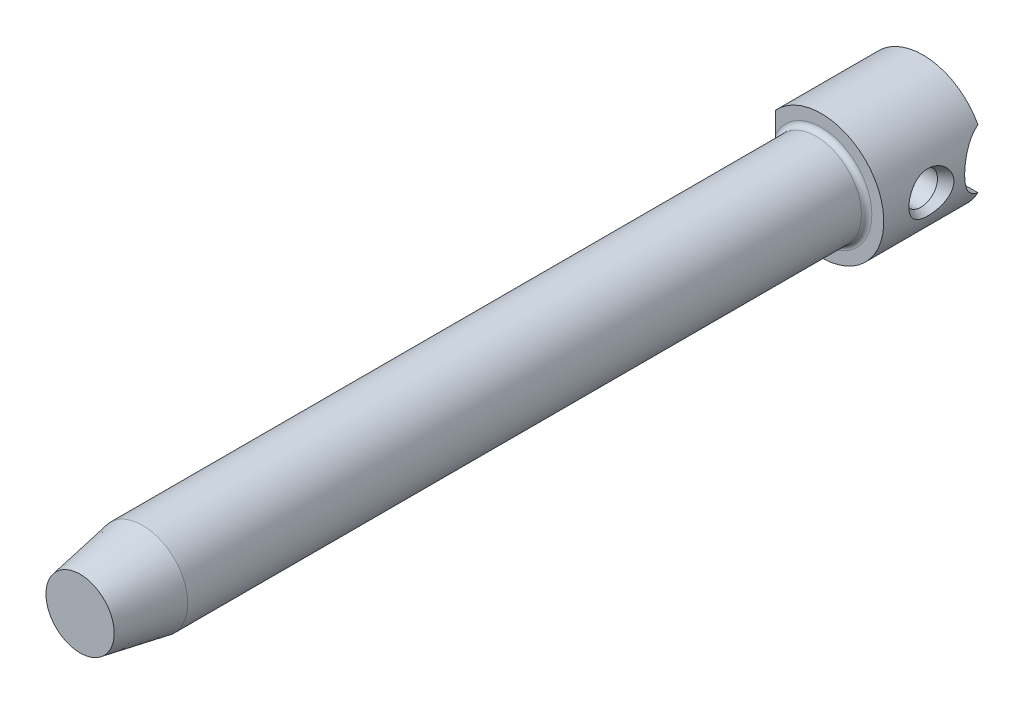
ISO-10303-21;
HEADER;
FILE_DESCRIPTION(('STEP AP214'),'2;1');
FILE_NAME('part.step','',(''),(''),'','','');
FILE_SCHEMA(('AUTOMOTIVE_DESIGN { 1 0 10303 214 1 1 1 1 }'));
ENDSEC;
DATA;
#1=APPLICATION_CONTEXT('core data for automotive mechanical design processes');
#2=APPLICATION_PROTOCOL_DEFINITION('international standard','automotive_design',2000,#1);
#3=PRODUCT_CONTEXT('',#1,'mechanical');
#4=PRODUCT('Part','Part','',(#3));
#5=PRODUCT_RELATED_PRODUCT_CATEGORY('part','',(#4));
#6=PRODUCT_DEFINITION_FORMATION('','',#4);
#7=PRODUCT_DEFINITION_CONTEXT('part definition',#1,'design');
#8=PRODUCT_DEFINITION('design','',#6,#7);
#9=PRODUCT_DEFINITION_SHAPE('','',#8);
#10=(LENGTH_UNIT() NAMED_UNIT(*) SI_UNIT(.MILLI.,.METRE.));
#11=(NAMED_UNIT(*) PLANE_ANGLE_UNIT() SI_UNIT($,.RADIAN.));
#12=(NAMED_UNIT(*) SI_UNIT($,.STERADIAN.) SOLID_ANGLE_UNIT());
#13=UNCERTAINTY_MEASURE_WITH_UNIT(LENGTH_MEASURE(1.E-05),#10,'distance_accuracy_value','');
#14=(GEOMETRIC_REPRESENTATION_CONTEXT(3) GLOBAL_UNCERTAINTY_ASSIGNED_CONTEXT((#13)) GLOBAL_UNIT_ASSIGNED_CONTEXT((#10,
#11,#12)) REPRESENTATION_CONTEXT('',''));
#15=CARTESIAN_POINT('',(0.,0.,0.));
#16=DIRECTION('',(0.,0.,1.));
#17=DIRECTION('',(1.,0.,0.));
#18=AXIS2_PLACEMENT_3D('',#15,#16,#17);
#19=CARTESIAN_POINT('',(0.,4.76249999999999,-4.1148));
#20=DIRECTION('',(0.,0.,1.));
#21=DIRECTION('',(1.,0.,0.));
#22=AXIS2_PLACEMENT_3D('',#19,#20,#21);
#23=PLANE('',#22);
#24=CARTESIAN_POINT('',(0.,0.,-4.1148));
#25=DIRECTION('',(0.,0.,1.));
#26=DIRECTION('',(1.,0.,0.));
#27=AXIS2_PLACEMENT_3D('',#24,#25,#26);
#28=CIRCLE('',#27,4.7625);
#29=CARTESIAN_POINT('',(4.20254878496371,2.24053340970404,-4.1148));
#30=VERTEX_POINT('',#29);
#31=CARTESIAN_POINT('',(-3.4798,3.2515224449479,-4.1148));
#32=VERTEX_POINT('',#31);
#33=EDGE_CURVE('E95',#30,#32,#28,.T.);
#34=ORIENTED_EDGE('',*,*,#33,.F.);
#35=DIRECTION('',(-1.,0.,0.));
#36=VECTOR('',#35,1.);
#37=CARTESIAN_POINT('',(4.7625,2.24053340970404,-4.1148));
#38=LINE('',#37,#36);
#39=CARTESIAN_POINT('',(-3.4798,2.24053340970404,-4.1148));
#40=VERTEX_POINT('',#39);
#41=EDGE_CURVE('E86',#30,#40,#38,.T.);
#42=ORIENTED_EDGE('',*,*,#41,.T.);
#43=DIRECTION('',(0.,-1.,0.));
#44=VECTOR('',#43,1.);
#45=CARTESIAN_POINT('',(-3.4798,3.2515224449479,-4.1148));
#46=LINE('',#45,#44);
#47=EDGE_CURVE('E94',#32,#40,#46,.T.);
#48=ORIENTED_EDGE('',*,*,#47,.F.);
#49=EDGE_LOOP('',(#34,#42,#48));
#50=FACE_BOUND('',#49,.T.);
#51=ADVANCED_FACE('F35',(#50),#23,.F.);
#52=CARTESIAN_POINT('',(-3.4798,-2.24053340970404,-4.1148));
#53=VERTEX_POINT('',#52);
#54=CARTESIAN_POINT('',(-3.4798,-3.2515224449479,-4.1148));
#55=VERTEX_POINT('',#54);
#56=EDGE_CURVE('E101',#53,#55,#46,.T.);
#57=ORIENTED_EDGE('',*,*,#56,.F.);
#58=DIRECTION('',(-1.,0.,0.));
#59=VECTOR('',#58,1.);
#60=CARTESIAN_POINT('',(4.7625,-2.24053340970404,-4.1148));
#61=LINE('',#60,#59);
#62=CARTESIAN_POINT('',(4.20254878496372,-2.24053340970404,-4.1148));
#63=VERTEX_POINT('',#62);
#64=EDGE_CURVE('E53',#63,#53,#61,.T.);
#65=ORIENTED_EDGE('',*,*,#64,.F.);
#66=EDGE_CURVE('E131',#55,#63,#28,.T.);
#67=ORIENTED_EDGE('',*,*,#66,.F.);
#68=EDGE_LOOP('',(#57,#65,#67));
#69=FACE_BOUND('',#68,.T.);
#70=ADVANCED_FACE('F37',(#69),#23,.F.);
#71=CARTESIAN_POINT('',(0.,0.,60.17895));
#72=DIRECTION('',(0.,0.,1.));
#73=DIRECTION('',(1.,0.,0.));
#74=AXIS2_PLACEMENT_3D('',#71,#72,#73);
#75=CYLINDRICAL_SURFACE('',#74,4.7625);
#76=CARTESIAN_POINT('',(4.62280607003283,-1.14501978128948,-1.16700098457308));
#77=CARTESIAN_POINT('',(4.60822032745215,-1.20390915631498,-1.09742034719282));
#78=CARTESIAN_POINT('',(4.5938462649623,-1.25713064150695,-1.02297208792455));
#79=CARTESIAN_POINT('',(4.56700143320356,-1.35141195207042,-0.8663937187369));
#80=CARTESIAN_POINT('',(4.55453204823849,-1.39246295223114,-0.784258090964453));
#81=CARTESIAN_POINT('',(4.53201445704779,-1.46416186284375,-0.608377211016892));
#82=CARTESIAN_POINT('',(4.52219671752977,-1.49388085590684,-0.514221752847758));
#83=CARTESIAN_POINT('',(4.50737893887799,-1.53801433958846,-0.322037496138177));
#84=CARTESIAN_POINT('',(4.50237852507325,-1.55243002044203,-0.224008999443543));
#85=CARTESIAN_POINT('',(4.49777314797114,-1.56572567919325,-0.0255009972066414));
#86=CARTESIAN_POINT('',(4.49823845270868,-1.5644033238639,0.0749938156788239));
#87=CARTESIAN_POINT('',(4.50467786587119,-1.54576110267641,0.274311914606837));
#88=CARTESIAN_POINT('',(4.51065239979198,-1.52844000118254,0.373135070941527));
#89=CARTESIAN_POINT('',(4.52733932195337,-1.47827426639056,0.566000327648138));
#90=CARTESIAN_POINT('',(4.538036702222,-1.44547878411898,0.660056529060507));
#91=CARTESIAN_POINT('',(4.56287938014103,-1.36502854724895,0.841125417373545));
#92=CARTESIAN_POINT('',(4.57702546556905,-1.31737039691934,0.928136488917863));
#93=CARTESIAN_POINT('',(4.60713375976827,-1.20787103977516,1.09281234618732));
#94=CARTESIAN_POINT('',(4.62310159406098,-1.14598526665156,1.17044656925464));
#95=CARTESIAN_POINT('',(4.65486662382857,-1.00922487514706,1.31338735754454));
#96=CARTESIAN_POINT('',(4.67066385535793,-0.934353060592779,1.37869657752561));
#97=CARTESIAN_POINT('',(4.69924475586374,-0.777504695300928,1.49112404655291));
#98=CARTESIAN_POINT('',(4.71214312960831,-0.696107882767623,1.53901759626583));
#99=CARTESIAN_POINT('',(4.73421636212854,-0.525332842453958,1.61872224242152));
#100=CARTESIAN_POINT('',(4.74339540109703,-0.435963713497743,1.65055140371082));
#101=CARTESIAN_POINT('',(4.75592212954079,-0.263110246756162,1.69349239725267));
#102=CARTESIAN_POINT('',(4.75982572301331,-0.180157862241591,1.70658988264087));
#103=CARTESIAN_POINT('',(4.76321218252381,-0.013165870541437,1.71796842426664));
#104=CARTESIAN_POINT('',(4.76269728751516,0.0708731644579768,1.71625698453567));
#105=CARTESIAN_POINT('',(4.75753391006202,0.230562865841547,1.69886217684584));
#106=CARTESIAN_POINT('',(4.75321662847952,0.306350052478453,1.68429811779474));
#107=CARTESIAN_POINT('',(4.74135413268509,0.454406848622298,1.64342553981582));
#108=CARTESIAN_POINT('',(4.73380866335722,0.526676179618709,1.61711609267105));
#109=CARTESIAN_POINT('',(4.71597944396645,0.66795088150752,1.55298124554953));
#110=CARTESIAN_POINT('',(4.70562614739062,0.736811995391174,1.51485926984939));
#111=CARTESIAN_POINT('',(4.68324890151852,0.867759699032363,1.42876996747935));
#112=CARTESIAN_POINT('',(4.67122433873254,0.929843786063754,1.38079902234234));
#113=CARTESIAN_POINT('',(4.64525864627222,1.05227824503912,1.27106111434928));
#114=CARTESIAN_POINT('',(4.63124745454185,1.11179724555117,1.20838367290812));
#115=CARTESIAN_POINT('',(4.60377487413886,1.2205808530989,1.07457765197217));
#116=CARTESIAN_POINT('',(4.59031375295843,1.2698405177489,1.00344502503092));
#117=CARTESIAN_POINT('',(4.56389388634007,1.36191377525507,0.846815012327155));
#118=CARTESIAN_POINT('',(4.55112725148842,1.40355321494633,0.76059252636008));
#119=CARTESIAN_POINT('',(4.52918423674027,1.47282789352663,0.582263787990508));
#120=CARTESIAN_POINT('',(4.52000848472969,1.50046068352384,0.490156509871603));
#121=CARTESIAN_POINT('',(4.50601038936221,1.54200702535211,0.298646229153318));
#122=CARTESIAN_POINT('',(4.50137827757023,1.55532316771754,0.199098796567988));
#123=CARTESIAN_POINT('',(4.49770965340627,1.56590117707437,-0.000943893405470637));
#124=CARTESIAN_POINT('',(4.49867305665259,1.56316328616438,-0.101439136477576));
#125=CARTESIAN_POINT('',(4.50605763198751,1.54174416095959,-0.30011429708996));
#126=CARTESIAN_POINT('',(4.51245771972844,1.52312451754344,-0.398301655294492));
#127=CARTESIAN_POINT('',(4.5298991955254,1.47043630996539,-0.590021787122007));
#128=CARTESIAN_POINT('',(4.54094137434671,1.43636511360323,-0.683553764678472));
#129=CARTESIAN_POINT('',(4.56639538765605,1.35326605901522,-0.863732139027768));
#130=CARTESIAN_POINT('',(4.58082161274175,1.30417404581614,-0.95034695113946));
#131=CARTESIAN_POINT('',(4.61129537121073,1.19194501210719,-1.11368045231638));
#132=CARTESIAN_POINT('',(4.62734312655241,1.1288060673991,-1.19039778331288));
#133=CARTESIAN_POINT('',(4.65879285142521,0.990935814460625,-1.32993884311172));
#134=CARTESIAN_POINT('',(4.6742012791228,0.916441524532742,-1.39299410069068));
#135=CARTESIAN_POINT('',(4.70270212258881,0.756671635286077,-1.50424579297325));
#136=CARTESIAN_POINT('',(4.71579645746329,0.671405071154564,-1.55245456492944));
#137=CARTESIAN_POINT('',(4.73676115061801,0.501136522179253,-1.62759493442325));
#138=CARTESIAN_POINT('',(4.74501080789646,0.416885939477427,-1.65611808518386));
#139=CARTESIAN_POINT('',(4.75701397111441,0.244287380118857,-1.69720047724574));
#140=CARTESIAN_POINT('',(4.7607716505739,0.15594328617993,-1.70977453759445));
#141=CARTESIAN_POINT('',(4.76314136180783,-0.0117272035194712,-1.71772253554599));
#142=CARTESIAN_POINT('',(4.76227746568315,-0.0909680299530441,-1.71484810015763));
#143=CARTESIAN_POINT('',(4.75669850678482,-0.247737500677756,-1.6960417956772));
#144=CARTESIAN_POINT('',(4.75198369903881,-0.325266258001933,-1.68011079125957));
#145=CARTESIAN_POINT('',(4.73936339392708,-0.474707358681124,-1.63648954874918));
#146=CARTESIAN_POINT('',(4.73153265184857,-0.546707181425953,-1.6090740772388));
#147=CARTESIAN_POINT('',(4.71344491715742,-0.685373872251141,-1.54367274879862));
#148=CARTESIAN_POINT('',(4.7031878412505,-0.752040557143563,-1.50568652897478));
#149=CARTESIAN_POINT('',(4.68146867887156,-0.877023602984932,-1.42167289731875));
#150=CARTESIAN_POINT('',(4.67004955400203,-0.935524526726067,-1.37590715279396));
#151=CARTESIAN_POINT('',(4.64664252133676,-1.04560489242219,-1.27683335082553));
#152=CARTESIAN_POINT('',(4.63465445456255,-1.09718238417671,-1.22352317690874));
#153=CARTESIAN_POINT('',(4.62280607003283,-1.14501978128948,-1.16700098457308));
#154=B_SPLINE_CURVE_WITH_KNOTS('',3,(#76,#77,#78,#79,#80,#81,#82,#83,#84,#85,#86,#87,#88,#89,
#90,#91,#92,#93,#94,#95,#96,#97,#98,#99,#100,#101,#102,#103,#104,#105,#106,#107,#108,#109,#110,
#111,#112,#113,#114,#115,#116,#117,#118,#119,#120,#121,#122,#123,#124,#125,#126,#127,#128,#129,
#130,#131,#132,#133,#134,#135,#136,#137,#138,#139,#140,#141,#142,#143,#144,#145,#146,#147,#148,
#149,#150,#151,#152,#153),.UNSPECIFIED.,.T.,.F.,(4,2,2,2,2,2,2,2,2,2,2,2,2,2,2,2,2,2,2,2,2,2,2,
2,2,2,2,2,2,2,2,2,2,2,2,2,2,2,4),(0.,0.276702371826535,0.553604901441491,0.849882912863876,
1.14613787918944,1.44620566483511,1.7462966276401,2.04544076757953,2.34465330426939,
2.64481617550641,2.94491431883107,3.2292498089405,3.51326483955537,3.76410498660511,
4.01481803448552,4.24563945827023,4.47647912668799,4.71366192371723,4.95093201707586,
5.21254516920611,5.47428406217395,5.76278622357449,6.05133880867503,6.3515136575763,
6.65168397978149,6.95069547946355,7.2497579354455,7.55011597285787,7.85051517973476,
8.14533651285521,8.43991218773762,8.70637396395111,8.97258797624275,9.20930140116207,
9.44599915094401,9.67733101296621,9.9086708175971,10.1333803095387,10.3581529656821),.UNSPECIFIED.);
#155=CARTESIAN_POINT('',(4.62280607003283,-1.14501978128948,-1.16700098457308));
#156=VERTEX_POINT('',#155);
#157=EDGE_CURVE('E11',#156,#156,#154,.T.);
#158=ORIENTED_EDGE('',*,*,#157,.T.);
#159=EDGE_LOOP('',(#158));
#160=FACE_BOUND('',#159,.T.);
#161=ORIENTED_EDGE('',*,*,#66,.T.);
#162=CARTESIAN_POINT('',(4.20254878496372,-2.24053340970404,-4.1148));
#163=CARTESIAN_POINT('',(4.22731920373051,-2.19403434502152,-3.98559059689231));
#164=CARTESIAN_POINT('',(4.25690380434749,-2.13675005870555,-3.86151437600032));
#165=CARTESIAN_POINT('',(4.32155477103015,-2.00277569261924,-3.62604764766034));
#166=CARTESIAN_POINT('',(4.35661484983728,-1.92610780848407,-3.51464284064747));
#167=CARTESIAN_POINT('',(4.42808293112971,-1.75556436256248,-3.30681491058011));
#168=CARTESIAN_POINT('',(4.46448847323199,-1.66171907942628,-3.21036596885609));
#169=CARTESIAN_POINT('',(4.53492318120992,-1.45857175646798,-3.0341913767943));
#170=CARTESIAN_POINT('',(4.56895141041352,-1.34926367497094,-2.95447229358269));
#171=CARTESIAN_POINT('',(4.63180913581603,-1.11480548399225,-2.81251813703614));
#172=CARTESIAN_POINT('',(4.66050412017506,-0.989353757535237,-2.75071779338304));
#173=CARTESIAN_POINT('',(4.70839839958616,-0.727996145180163,-2.64969760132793));
#174=CARTESIAN_POINT('',(4.72760632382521,-0.592099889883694,-2.61045722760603));
#175=CARTESIAN_POINT('',(4.75296288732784,-0.326914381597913,-2.55903735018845));
#176=CARTESIAN_POINT('',(4.7601324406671,-0.198133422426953,-2.54473779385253));
#177=CARTESIAN_POINT('',(4.76386846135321,0.0601775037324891,-2.53726071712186));
#178=CARTESIAN_POINT('',(4.76043871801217,0.189707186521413,-2.54407564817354));
#179=CARTESIAN_POINT('',(4.74396162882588,0.436448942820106,-2.57725817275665));
#180=CARTESIAN_POINT('',(4.73159068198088,0.553896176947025,-2.60225138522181));
#181=CARTESIAN_POINT('',(4.69916175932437,0.782716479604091,-2.66915762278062));
#182=CARTESIAN_POINT('',(4.67910342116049,0.894089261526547,-2.711071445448));
#183=CARTESIAN_POINT('',(4.63212330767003,1.11257494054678,-2.81231668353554));
#184=CARTESIAN_POINT('',(4.60496200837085,1.21934650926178,-2.87226993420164));
#185=CARTESIAN_POINT('',(4.54654132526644,1.42179183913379,-3.00717638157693));
#186=CARTESIAN_POINT('',(4.51527806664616,1.51745494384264,-3.08214379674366));
#187=CARTESIAN_POINT('',(4.44805269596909,1.70503127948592,-3.25362856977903));
#188=CARTESIAN_POINT('',(4.41193413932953,1.79560108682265,-3.35155460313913));
#189=CARTESIAN_POINT('',(4.34169262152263,1.95934811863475,-3.56148079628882));
#190=CARTESIAN_POINT('',(4.30756650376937,2.03255344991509,-3.67345775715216));
#191=CARTESIAN_POINT('',(4.26274029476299,2.12401101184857,-3.84310383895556));
#192=CARTESIAN_POINT('',(4.24962944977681,2.15006905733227,-3.89604116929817));
#193=CARTESIAN_POINT('',(4.22489698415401,2.19826703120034,-4.00393997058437));
#194=CARTESIAN_POINT('',(4.21327393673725,2.22041072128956,-4.05889943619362));
#195=CARTESIAN_POINT('',(4.20254878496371,2.24053340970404,-4.1148));
#196=B_SPLINE_CURVE_WITH_KNOTS('',3,(#162,#163,#164,#165,#166,#167,#168,#169,#170,#171,#172,
#173,#174,#175,#176,#177,#178,#179,#180,#181,#182,#183,#184,#185,#186,#187,#188,#189,#190,#191,
#192,#193,#194,#195),.UNSPECIFIED.,.F.,.F.,(4,2,2,2,2,2,2,2,2,2,2,2,2,2,2,2,4),(0.,
0.417608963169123,0.834741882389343,1.25114647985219,1.66771422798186,2.09367415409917,
2.5192459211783,2.906464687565,3.29354503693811,3.65405282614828,4.01457761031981,
4.38932361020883,4.76442618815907,5.17723212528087,5.58936524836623,5.77054044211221,
5.95154056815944),.UNSPECIFIED.);
#197=EDGE_CURVE('E105',#63,#30,#196,.T.);
#198=ORIENTED_EDGE('',*,*,#197,.T.);
#199=ORIENTED_EDGE('',*,*,#33,.T.);
#200=DIRECTION('',(0.,0.,-1.));
#201=VECTOR('',#200,1.);
#202=CARTESIAN_POINT('',(-3.4798,3.2515224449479,60.17895));
#203=LINE('',#202,#201);
#204=CARTESIAN_POINT('',(-3.4798,3.2515224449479,3.6322));
#205=VERTEX_POINT('',#204);
#206=EDGE_CURVE('E100',#205,#32,#203,.T.);
#207=ORIENTED_EDGE('',*,*,#206,.F.);
#208=CARTESIAN_POINT('',(0.,0.,3.6322));
#209=DIRECTION('',(0.,0.,1.));
#210=DIRECTION('',(1.,0.,0.));
#211=AXIS2_PLACEMENT_3D('',#208,#209,#210);
#212=CIRCLE('',#211,4.7625);
#213=CARTESIAN_POINT('',(-3.4798,-3.2515224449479,3.6322));
#214=VERTEX_POINT('',#213);
#215=EDGE_CURVE('E128',#214,#205,#212,.T.);
#216=ORIENTED_EDGE('',*,*,#215,.F.);
#217=DIRECTION('',(0.,0.,-1.));
#218=VECTOR('',#217,1.);
#219=CARTESIAN_POINT('',(-3.4798,-3.2515224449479,60.17895));
#220=LINE('',#219,#218);
#221=EDGE_CURVE('E103',#214,#55,#220,.T.);
#222=ORIENTED_EDGE('',*,*,#221,.T.);
#223=EDGE_LOOP('',(#161,#198,#199,#207,#216,#222));
#224=FACE_BOUND('',#223,.T.);
#225=ADVANCED_FACE('F168',(#160,#224),#75,.T.);
#226=CARTESIAN_POINT('',(0.,3.85127499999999,3.6322));
#227=DIRECTION('',(0.,0.,-1.));
#228=DIRECTION('',(-1.,0.,0.));
#229=AXIS2_PLACEMENT_3D('',#226,#227,#228);
#230=PLANE('',#229);
#231=ORIENTED_EDGE('',*,*,#215,.T.);
#232=DIRECTION('',(0.,-1.,0.));
#233=VECTOR('',#232,1.);
#234=CARTESIAN_POINT('',(-3.4798,3.85127499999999,3.6322));
#235=LINE('',#234,#233);
#236=CARTESIAN_POINT('',(-3.4798,1.65024576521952,3.6322));
#237=VERTEX_POINT('',#236);
#238=EDGE_CURVE('E115',#205,#237,#235,.T.);
#239=ORIENTED_EDGE('',*,*,#238,.T.);
#240=CARTESIAN_POINT('',(0.,0.,3.6322));
#241=DIRECTION('',(0.,0.,1.));
#242=DIRECTION('',(1.,0.,0.));
#243=AXIS2_PLACEMENT_3D('',#240,#241,#242);
#244=CIRCLE('',#243,3.851275);
#245=CARTESIAN_POINT('',(-3.47980000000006,-1.65024576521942,3.6322));
#246=VERTEX_POINT('',#245);
#247=EDGE_CURVE('E125',#246,#237,#244,.T.);
#248=ORIENTED_EDGE('',*,*,#247,.F.);
#249=EDGE_CURVE('E61',#246,#214,#235,.T.);
#250=ORIENTED_EDGE('',*,*,#249,.T.);
#251=EDGE_LOOP('',(#231,#239,#248,#250));
#252=FACE_BOUND('',#251,.T.);
#253=ADVANCED_FACE('F160',(#252),#230,.F.);
#254=CARTESIAN_POINT('',(0.,0.,4.029075));
#255=DIRECTION('',(0.,0.,1.));
#256=DIRECTION('',(1.,0.,0.));
#257=AXIS2_PLACEMENT_3D('',#254,#255,#256);
#258=TOROIDAL_SURFACE('',#257,3.851275,0.396875);
#259=CARTESIAN_POINT('',(0.,0.,4.02907500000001));
#260=DIRECTION('',(0.,0.,1.));
#261=DIRECTION('',(1.,0.,0.));
#262=AXIS2_PLACEMENT_3D('',#259,#260,#261);
#263=CIRCLE('',#262,3.4544);
#264=CARTESIAN_POINT('',(3.4544,0.,4.02907500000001));
#265=VERTEX_POINT('',#264);
#266=EDGE_CURVE('E122',#265,#265,#263,.T.);
#267=ORIENTED_EDGE('',*,*,#266,.F.);
#268=EDGE_LOOP('',(#267));
#269=FACE_BOUND('',#268,.T.);
#270=ORIENTED_EDGE('',*,*,#247,.T.);
#271=CARTESIAN_POINT('',(-3.4798,0.,3.889375));
#272=CARTESIAN_POINT('',(-3.4798,-0.0536264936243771,3.88937625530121));
#273=CARTESIAN_POINT('',(-3.4798,-0.107252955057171,3.88593063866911));
#274=CARTESIAN_POINT('',(-3.4798,-0.214085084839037,3.8738463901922));
#275=CARTESIAN_POINT('',(-3.4798,-0.267287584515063,3.86518339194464));
#276=CARTESIAN_POINT('',(-3.4798,-0.374235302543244,3.84506610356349));
#277=CARTESIAN_POINT('',(-3.4798,-0.427969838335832,3.83355906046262));
#278=CARTESIAN_POINT('',(-3.4798,-0.535119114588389,3.80960553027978));
#279=CARTESIAN_POINT('',(-3.4798,-0.588534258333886,3.79716078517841));
#280=CARTESIAN_POINT('',(-3.4798,-0.695334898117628,3.77235472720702));
#281=CARTESIAN_POINT('',(-3.4798,-0.748720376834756,3.75999334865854));
#282=CARTESIAN_POINT('',(-3.4798,-0.855662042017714,3.73604212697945));
#283=CARTESIAN_POINT('',(-3.4798,-0.909218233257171,3.72445230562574));
#284=CARTESIAN_POINT('',(-3.4798,-1.07061074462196,3.69161409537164));
#285=CARTESIAN_POINT('',(-3.4798,-1.17889915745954,3.67236647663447));
#286=CARTESIAN_POINT('',(-3.4798,-1.34119739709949,3.6509931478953));
#287=CARTESIAN_POINT('',(-3.4798,-1.39470759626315,3.64514228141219));
#288=CARTESIAN_POINT('',(-3.4798,-1.50196292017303,3.63642696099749));
#289=CARTESIAN_POINT('',(-3.4798,-1.55570793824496,3.63356126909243));
#290=CARTESIAN_POINT('',(-3.4798,-1.66303675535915,3.63159635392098));
#291=CARTESIAN_POINT('',(-3.4798,-1.71662017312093,3.63248002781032));
#292=CARTESIAN_POINT('',(-3.4798,-1.8234760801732,3.63898533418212));
#293=CARTESIAN_POINT('',(-3.4798,-1.8767489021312,3.64460026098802));
#294=CARTESIAN_POINT('',(-3.4798,-1.9609844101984,3.65848373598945));
#295=CARTESIAN_POINT('',(-3.4798,-1.99227269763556,3.66476630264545));
#296=CARTESIAN_POINT('',(-3.4798,-2.05431309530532,3.67997271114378));
#297=CARTESIAN_POINT('',(-3.4798,-2.08506346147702,3.68890389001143));
#298=CARTESIAN_POINT('',(-3.4798,-2.14566954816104,3.7100064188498));
#299=CARTESIAN_POINT('',(-3.4798,-2.17551844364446,3.72219774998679));
#300=CARTESIAN_POINT('',(-3.4798,-2.23328638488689,3.75050329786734));
#301=CARTESIAN_POINT('',(-3.4798,-2.26121040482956,3.76660687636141));
#302=CARTESIAN_POINT('',(-3.4798,-2.30296050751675,3.79603726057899));
#303=CARTESIAN_POINT('',(-3.4798,-2.31788057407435,3.80780485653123));
#304=CARTESIAN_POINT('',(-3.4798,-2.3460793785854,3.83321909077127));
#305=CARTESIAN_POINT('',(-3.4798,-2.3593569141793,3.84686709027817));
#306=CARTESIAN_POINT('',(-3.4798,-2.3837429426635,3.87635118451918));
#307=CARTESIAN_POINT('',(-3.4798,-2.39481769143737,3.89221578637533));
#308=CARTESIAN_POINT('',(-3.4798,-2.41357176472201,3.92583596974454));
#309=CARTESIAN_POINT('',(-3.4798,-2.42126270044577,3.94358482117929));
#310=CARTESIAN_POINT('',(-3.4798,-2.43053372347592,3.97448842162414));
#311=CARTESIAN_POINT('',(-3.4798,-2.43328172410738,3.98729583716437));
#312=CARTESIAN_POINT('',(-3.4798,-2.43656931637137,4.0131922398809));
#313=CARTESIAN_POINT('',(-3.4798,-2.43711015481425,4.0262810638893));
#314=CARTESIAN_POINT('',(-3.4798,-2.43593700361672,4.05235500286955));
#315=CARTESIAN_POINT('',(-3.4798,-2.43422301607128,4.06534011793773));
#316=CARTESIAN_POINT('',(-3.4798,-2.42868132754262,4.09084952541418));
#317=CARTESIAN_POINT('',(-3.4798,-2.42485230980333,4.10337352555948));
#318=CARTESIAN_POINT('',(-3.4798,-2.41414195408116,4.13076855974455));
#319=CARTESIAN_POINT('',(-3.4798,-2.40673375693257,4.14543276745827));
#320=CARTESIAN_POINT('',(-3.4798,-2.3896325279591,4.17335673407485));
#321=CARTESIAN_POINT('',(-3.4798,-2.37993556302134,4.18661401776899));
#322=CARTESIAN_POINT('',(-3.4798,-2.3540602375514,4.2173219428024));
#323=CARTESIAN_POINT('',(-3.4798,-2.33693132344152,4.2339666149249));
#324=CARTESIAN_POINT('',(-3.4798,-2.30033404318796,4.26441731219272));
#325=CARTESIAN_POINT('',(-3.4798,-2.28086080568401,4.27821725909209));
#326=CARTESIAN_POINT('',(-3.4798,-2.22637192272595,4.31206674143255));
#327=CARTESIAN_POINT('',(-3.4798,-2.18993978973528,4.32981713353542));
#328=CARTESIAN_POINT('',(-3.4798,-2.11492101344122,4.35986491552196));
#329=CARTESIAN_POINT('',(-3.4798,-2.07632889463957,4.37214766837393));
#330=CARTESIAN_POINT('',(-3.4798,-1.9992122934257,4.39210909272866));
#331=CARTESIAN_POINT('',(-3.4798,-1.96071929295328,4.39991270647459));
#332=CARTESIAN_POINT('',(-3.4798,-1.88319847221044,4.41223978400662));
#333=CARTESIAN_POINT('',(-3.4798,-1.84417016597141,4.4167600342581));
#334=CARTESIAN_POINT('',(-3.4798,-1.72675914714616,4.42629220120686));
#335=CARTESIAN_POINT('',(-3.4798,-1.64805187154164,4.427275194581));
#336=CARTESIAN_POINT('',(-3.4798,-1.50309429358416,4.42215275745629));
#337=CARTESIAN_POINT('',(-3.4798,-1.43678660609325,4.41711237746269));
#338=CARTESIAN_POINT('',(-3.4798,-1.30459753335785,4.40296605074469));
#339=CARTESIAN_POINT('',(-3.4798,-1.23871625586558,4.39385911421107));
#340=CARTESIAN_POINT('',(-3.4798,-1.10703047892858,4.37258962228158));
#341=CARTESIAN_POINT('',(-3.4798,-1.04122924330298,4.36040764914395));
#342=CARTESIAN_POINT('',(-3.4798,-0.910097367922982,4.33399954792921));
#343=CARTESIAN_POINT('',(-3.4798,-0.844766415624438,4.31977494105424));
#344=CARTESIAN_POINT('',(-3.4798,-0.709396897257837,4.28918694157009));
#345=CARTESIAN_POINT('',(-3.4798,-0.639377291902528,4.27274316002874));
#346=CARTESIAN_POINT('',(-3.4798,-0.499062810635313,4.24032493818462));
#347=CARTESIAN_POINT('',(-3.4798,-0.428767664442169,4.22435151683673));
#348=CARTESIAN_POINT('',(-3.4798,-0.323298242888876,4.2033355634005));
#349=CARTESIAN_POINT('',(-3.4798,-0.28841990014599,4.19686182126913));
#350=CARTESIAN_POINT('',(-3.4798,-0.218402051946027,4.18549431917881));
#351=CARTESIAN_POINT('',(-3.4798,-0.183262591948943,4.1806002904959));
#352=CARTESIAN_POINT('',(-3.4798,-0.112887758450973,4.17315606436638));
#353=CARTESIAN_POINT('',(-3.4798,-0.0776536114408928,4.17059496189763));
#354=CARTESIAN_POINT('',(-3.4798,-0.00709755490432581,4.16832333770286));
#355=CARTESIAN_POINT('',(-3.4798,0.0282243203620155,4.1686118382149));
#356=CARTESIAN_POINT('',(-3.4798,0.134266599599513,4.17370438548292));
#357=CARTESIAN_POINT('',(-3.4798,0.204765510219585,4.18276849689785));
#358=CARTESIAN_POINT('',(-3.4798,0.309801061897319,4.2007350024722));
#359=CARTESIAN_POINT('',(-3.4798,0.344799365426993,4.20747944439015));
#360=CARTESIAN_POINT('',(-3.4798,0.414625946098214,4.22180690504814));
#361=CARTESIAN_POINT('',(-3.4798,0.449454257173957,4.22938974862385));
#362=CARTESIAN_POINT('',(-3.4798,0.555102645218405,4.25302113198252));
#363=CARTESIAN_POINT('',(-3.4798,0.625776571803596,4.26969097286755));
#364=CARTESIAN_POINT('',(-3.4798,0.767106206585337,4.302359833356));
#365=CARTESIAN_POINT('',(-3.4798,0.837761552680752,4.31836036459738));
#366=CARTESIAN_POINT('',(-3.4798,0.979421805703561,4.34833105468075));
#367=CARTESIAN_POINT('',(-3.4798,1.05042617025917,4.36230370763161));
#368=CARTESIAN_POINT('',(-3.4798,1.19309785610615,4.38702502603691));
#369=CARTESIAN_POINT('',(-3.4798,1.26476583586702,4.39777003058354));
#370=CARTESIAN_POINT('',(-3.4798,1.40839640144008,4.41464614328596));
#371=CARTESIAN_POINT('',(-3.4798,1.48035692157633,4.42079414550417));
#372=CARTESIAN_POINT('',(-3.4798,1.6245119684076,4.4268824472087));
#373=CARTESIAN_POINT('',(-3.4798,1.69670595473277,4.42683241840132));
#374=CARTESIAN_POINT('',(-3.4798,1.80521513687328,4.42030096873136));
#375=CARTESIAN_POINT('',(-3.4798,1.84172051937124,4.41699343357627));
#376=CARTESIAN_POINT('',(-3.4798,1.91438422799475,4.40772300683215));
#377=CARTESIAN_POINT('',(-3.4798,1.95054276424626,4.40176184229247));
#378=CARTESIAN_POINT('',(-3.4798,2.02200406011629,4.38666975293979));
#379=CARTESIAN_POINT('',(-3.4798,2.05731040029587,4.37755621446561));
#380=CARTESIAN_POINT('',(-3.4798,2.12665191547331,4.35543126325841));
#381=CARTESIAN_POINT('',(-3.4798,2.16068967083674,4.34242831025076));
#382=CARTESIAN_POINT('',(-3.4798,2.21936442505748,4.31488600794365));
#383=CARTESIAN_POINT('',(-3.4798,2.24443921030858,4.30129151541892));
#384=CARTESIAN_POINT('',(-3.4798,2.29228850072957,4.27050117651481));
#385=CARTESIAN_POINT('',(-3.4798,2.31506864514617,4.25331449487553));
#386=CARTESIAN_POINT('',(-3.4798,2.3486963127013,4.22223369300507));
#387=CARTESIAN_POINT('',(-3.4798,2.360746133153,4.20964616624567));
#388=CARTESIAN_POINT('',(-3.4798,2.38286136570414,4.18282051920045));
#389=CARTESIAN_POINT('',(-3.4798,2.3929291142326,4.16858437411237));
#390=CARTESIAN_POINT('',(-3.4798,2.40883655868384,4.14123138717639));
#391=CARTESIAN_POINT('',(-3.4798,2.41511032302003,4.12836923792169));
#392=CARTESIAN_POINT('',(-3.4798,2.42544421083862,4.10177933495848));
#393=CARTESIAN_POINT('',(-3.4798,2.42950617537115,4.08805231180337));
#394=CARTESIAN_POINT('',(-3.4798,2.43509392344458,4.05998967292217));
#395=CARTESIAN_POINT('',(-3.4798,2.43660333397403,4.04565072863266));
#396=CARTESIAN_POINT('',(-3.4798,2.43688308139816,4.01694646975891));
#397=CARTESIAN_POINT('',(-3.4798,2.43565383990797,4.0025811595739));
#398=CARTESIAN_POINT('',(-3.4798,2.43083966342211,3.97575547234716));
#399=CARTESIAN_POINT('',(-3.4798,2.42750418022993,3.96324885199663));
#400=CARTESIAN_POINT('',(-3.4798,2.41896383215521,3.93889785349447));
#401=CARTESIAN_POINT('',(-3.4798,2.41375832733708,3.92705370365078));
#402=CARTESIAN_POINT('',(-3.4798,2.39931807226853,3.89951129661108));
#403=CARTESIAN_POINT('',(-3.4798,2.38930626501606,3.88422109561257));
#404=CARTESIAN_POINT('',(-3.4798,2.36696749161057,3.85543874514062));
#405=CARTESIAN_POINT('',(-3.4798,2.35463516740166,3.8419508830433));
#406=CARTESIAN_POINT('',(-3.4798,2.32132738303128,3.81002177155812));
#407=CARTESIAN_POINT('',(-3.4798,2.29923803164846,3.79274991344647));
#408=CARTESIAN_POINT('',(-3.4798,2.25273664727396,3.7617432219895));
#409=CARTESIAN_POINT('',(-3.4798,2.22832003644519,3.74801556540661));
#410=CARTESIAN_POINT('',(-3.4798,2.15864066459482,3.71402823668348));
#411=CARTESIAN_POINT('',(-3.4798,2.11185404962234,3.69692249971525));
#412=CARTESIAN_POINT('',(-3.4798,2.01636417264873,3.66950802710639));
#413=CARTESIAN_POINT('',(-3.4798,1.96765581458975,3.65921885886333));
#414=CARTESIAN_POINT('',(-3.4798,1.86846297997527,3.64369953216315));
#415=CARTESIAN_POINT('',(-3.4798,1.81796250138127,3.63857578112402));
#416=CARTESIAN_POINT('',(-3.4798,1.71668137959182,3.63256167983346));
#417=CARTESIAN_POINT('',(-3.4798,1.66590046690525,3.63167657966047));
#418=CARTESIAN_POINT('',(-3.4798,1.56420820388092,3.63328658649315));
#419=CARTESIAN_POINT('',(-3.4798,1.51329712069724,3.63579493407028));
#420=CARTESIAN_POINT('',(-3.4798,1.41175557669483,3.64353916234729));
#421=CARTESIAN_POINT('',(-3.4798,1.36112485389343,3.64877179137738));
#422=CARTESIAN_POINT('',(-3.4798,1.19928857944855,3.66902799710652));
#423=CARTESIAN_POINT('',(-3.4798,1.08861736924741,3.68825130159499));
#424=CARTESIAN_POINT('',(-3.4798,0.923301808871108,3.72146617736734));
#425=CARTESIAN_POINT('',(-3.4798,0.868173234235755,3.73330333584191));
#426=CARTESIAN_POINT('',(-3.4798,0.758118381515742,3.75783676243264));
#427=CARTESIAN_POINT('',(-3.4798,0.703192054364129,3.77053280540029));
#428=CARTESIAN_POINT('',(-3.4798,0.59458860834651,3.79575227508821));
#429=CARTESIAN_POINT('',(-3.4798,0.540910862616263,3.80827326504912));
#430=CARTESIAN_POINT('',(-3.4798,0.43329154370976,3.83240367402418));
#431=CARTESIAN_POINT('',(-3.4798,0.37934977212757,3.84401223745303));
#432=CARTESIAN_POINT('',(-3.4798,0.271456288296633,3.86448274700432));
#433=CARTESIAN_POINT('',(-3.4798,0.217509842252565,3.87337046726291));
#434=CARTESIAN_POINT('',(-3.4798,0.109041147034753,3.88580968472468));
#435=CARTESIAN_POINT('',(-3.4798,0.0545205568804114,3.88937372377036));
#436=CARTESIAN_POINT('',(-3.4798,0.,3.889375));
#437=B_SPLINE_CURVE_WITH_KNOTS('',3,(#271,#272,#273,#274,#275,#276,#277,#278,#279,#280,#281,
#282,#283,#284,#285,#286,#287,#288,#289,#290,#291,#292,#293,#294,#295,#296,#297,#298,#299,#300,
#301,#302,#303,#304,#305,#306,#307,#308,#309,#310,#311,#312,#313,#314,#315,#316,#317,#318,#319,
#320,#321,#322,#323,#324,#325,#326,#327,#328,#329,#330,#331,#332,#333,#334,#335,#336,#337,#338,
#339,#340,#341,#342,#343,#344,#345,#346,#347,#348,#349,#350,#351,#352,#353,#354,#355,#356,#357,
#358,#359,#360,#361,#362,#363,#364,#365,#366,#367,#368,#369,#370,#371,#372,#373,#374,#375,#376,
#377,#378,#379,#380,#381,#382,#383,#384,#385,#386,#387,#388,#389,#390,#391,#392,#393,#394,#395,
#396,#397,#398,#399,#400,#401,#402,#403,#404,#405,#406,#407,#408,#409,#410,#411,#412,#413,#414,
#415,#416,#417,#418,#419,#420,#421,#422,#423,#424,#425,#426,#427,#428,#429,#430,#431,#432,#433,
#434,#435,#436),.UNSPECIFIED.,.T.,.F.,(4,2,2,2,2,2,2,2,2,2,2,2,2,2,2,2,2,2,2,2,2,2,2,2,2,2,2,2,
2,2,2,2,2,2,2,2,2,2,2,2,2,2,2,2,2,2,2,2,2,2,2,2,2,2,2,2,2,2,2,2,2,2,2,2,2,2,2,2,2,2,2,2,2,2,2,2,
2,2,2,2,2,2,4),(0.,0.160822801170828,0.322402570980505,0.487239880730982,0.651778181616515,
0.816166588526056,0.98055963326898,1.31018722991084,1.47161156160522,1.63296892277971,
1.79359104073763,1.95398588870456,2.04963761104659,2.14555681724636,2.24207793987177,
2.33833948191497,2.39521998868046,2.45214188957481,2.50987803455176,2.56741448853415,
2.60653958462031,2.64564257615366,2.68474553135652,2.72387285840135,2.77288936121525,
2.82199071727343,2.89324076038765,2.96464149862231,3.08553790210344,3.20675603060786,
3.3244041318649,3.44216722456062,3.67769808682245,3.87707013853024,4.07649074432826,
4.27720357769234,4.47776770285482,4.6935511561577,4.90977201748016,5.01617241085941,
5.12255469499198,5.22843711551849,5.33428320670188,5.54686329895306,5.65380529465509,
5.76072498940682,5.97856854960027,6.19589013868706,6.41294213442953,6.63023939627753,
6.84673410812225,7.06289099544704,7.17278105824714,7.28259970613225,7.39182208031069,
7.50080859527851,7.58615774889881,7.67129175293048,7.72342127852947,7.77548898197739,
7.81825088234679,7.8609771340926,7.90397642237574,7.94696909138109,7.9856362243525,
8.02431660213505,8.0788376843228,8.13348623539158,8.21713326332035,8.30094836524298,
8.44955545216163,8.59858729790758,8.75063005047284,8.90286107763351,9.0556877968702,
9.20833252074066,9.54493881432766,9.71410014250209,9.88321729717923,10.0485749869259,
10.2140859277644,10.3779766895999,10.5414807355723),.UNSPECIFIED.);
#438=EDGE_CURVE('E46',#237,#246,#437,.T.);
#439=ORIENTED_EDGE('',*,*,#438,.T.);
#440=EDGE_LOOP('',(#270,#439));
#441=FACE_BOUND('',#440,.T.);
#442=ADVANCED_FACE('F137',(#269,#441),#258,.F.);
#443=CARTESIAN_POINT('',(0.,0.,60.17895));
#444=DIRECTION('',(0.,0.,1.));
#445=DIRECTION('',(1.,0.,0.));
#446=AXIS2_PLACEMENT_3D('',#443,#444,#445);
#447=CYLINDRICAL_SURFACE('',#446,3.4544);
#448=CARTESIAN_POINT('',(0.,0.,55.41645));
#449=DIRECTION('',(0.,0.,1.));
#450=DIRECTION('',(1.,0.,0.));
#451=AXIS2_PLACEMENT_3D('',#448,#449,#450);
#452=CIRCLE('',#451,3.4544);
#453=CARTESIAN_POINT('',(3.4544,0.,55.41645));
#454=VERTEX_POINT('',#453);
#455=EDGE_CURVE('E119',#454,#454,#452,.T.);
#456=ORIENTED_EDGE('',*,*,#455,.F.);
#457=EDGE_LOOP('',(#456));
#458=FACE_BOUND('',#457,.T.);
#459=ORIENTED_EDGE('',*,*,#266,.T.);
#460=EDGE_LOOP('',(#459));
#461=FACE_BOUND('',#460,.T.);
#462=ADVANCED_FACE('F153',(#458,#461),#447,.T.);
#463=CARTESIAN_POINT('',(0.,0.,55.41645));
#464=DIRECTION('',(0.,0.,-1.));
#465=DIRECTION('',(-1.,0.,0.));
#466=AXIS2_PLACEMENT_3D('',#463,#464,#465);
#467=CONICAL_SURFACE('',#466,3.4544,0.176801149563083);
#468=CARTESIAN_POINT('',(0.,0.,60.17895));
#469=DIRECTION('',(0.,0.,1.));
#470=DIRECTION('',(1.,0.,0.));
#471=AXIS2_PLACEMENT_3D('',#468,#469,#470);
#472=CIRCLE('',#471,2.6035);
#473=CARTESIAN_POINT('',(2.6035,0.,60.17895));
#474=VERTEX_POINT('',#473);
#475=EDGE_CURVE('E116',#474,#474,#472,.T.);
#476=ORIENTED_EDGE('',*,*,#475,.F.);
#477=EDGE_LOOP('',(#476));
#478=FACE_BOUND('',#477,.T.);
#479=ORIENTED_EDGE('',*,*,#455,.T.);
#480=EDGE_LOOP('',(#479));
#481=FACE_BOUND('',#480,.T.);
#482=ADVANCED_FACE('F150',(#478,#481),#467,.T.);
#483=CARTESIAN_POINT('',(0.,0.,60.17895));
#484=DIRECTION('',(0.,0.,-1.));
#485=DIRECTION('',(-1.,0.,0.));
#486=AXIS2_PLACEMENT_3D('',#483,#484,#485);
#487=PLANE('',#486);
#488=ORIENTED_EDGE('',*,*,#475,.T.);
#489=EDGE_LOOP('',(#488));
#490=FACE_BOUND('',#489,.T.);
#491=ADVANCED_FACE('F144',(#490),#487,.F.);
#492=CARTESIAN_POINT('',(-3.4798,3.2515224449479,60.17895));
#493=DIRECTION('',(1.,0.,0.));
#494=DIRECTION('',(0.,0.,-1.));
#495=AXIS2_PLACEMENT_3D('',#492,#493,#494);
#496=PLANE('',#495);
#497=CARTESIAN_POINT('',(-3.4798,0.,0.));
#498=DIRECTION('',(-1.,0.,0.));
#499=DIRECTION('',(0.,0.,1.));
#500=AXIS2_PLACEMENT_3D('',#497,#498,#499);
#501=CIRCLE('',#500,1.71557177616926);
#502=CARTESIAN_POINT('',(-3.4798,0.,1.71557177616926));
#503=VERTEX_POINT('',#502);
#504=EDGE_CURVE('E90',#503,#503,#501,.T.);
#505=ORIENTED_EDGE('',*,*,#504,.F.);
#506=EDGE_LOOP('',(#505));
#507=FACE_BOUND('',#506,.T.);
#508=ORIENTED_EDGE('',*,*,#47,.T.);
#509=CARTESIAN_POINT('',(-3.4798,0.,-4.92125));
#510=DIRECTION('',(-1.,0.,0.));
#511=DIRECTION('',(0.,0.,1.));
#512=AXIS2_PLACEMENT_3D('',#509,#510,#511);
#513=CIRCLE('',#512,2.38125);
#514=EDGE_CURVE('E83',#53,#40,#513,.T.);
#515=ORIENTED_EDGE('',*,*,#514,.F.);
#516=ORIENTED_EDGE('',*,*,#56,.T.);
#517=ORIENTED_EDGE('',*,*,#221,.F.);
#518=ORIENTED_EDGE('',*,*,#249,.F.);
#519=ORIENTED_EDGE('',*,*,#438,.F.);
#520=ORIENTED_EDGE('',*,*,#238,.F.);
#521=ORIENTED_EDGE('',*,*,#206,.T.);
#522=EDGE_LOOP('',(#508,#515,#516,#517,#518,#519,#520,#521));
#523=FACE_BOUND('',#522,.T.);
#524=ADVANCED_FACE('F98',(#507,#523),#496,.F.);
#525=CARTESIAN_POINT('',(4.7625,0.,-4.92125));
#526=DIRECTION('',(-1.,0.,0.));
#527=DIRECTION('',(0.,0.,1.));
#528=AXIS2_PLACEMENT_3D('',#525,#526,#527);
#529=CYLINDRICAL_SURFACE('',#528,2.38125);
#530=ORIENTED_EDGE('',*,*,#64,.T.);
#531=ORIENTED_EDGE('',*,*,#514,.T.);
#532=ORIENTED_EDGE('',*,*,#41,.F.);
#533=ORIENTED_EDGE('',*,*,#197,.F.);
#534=EDGE_LOOP('',(#530,#531,#532,#533));
#535=FACE_BOUND('',#534,.T.);
#536=ADVANCED_FACE('F85',(#535),#529,.F.);
#537=CARTESIAN_POINT('',(3.96875,0.,0.));
#538=DIRECTION('',(1.,0.,0.));
#539=DIRECTION('',(0.,0.,-1.));
#540=AXIS2_PLACEMENT_3D('',#537,#538,#539);
#541=CONICAL_SURFACE('',#540,1.2573,0.523598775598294);
#542=CARTESIAN_POINT('',(3.96875,0.,0.));
#543=DIRECTION('',(-1.,0.,0.));
#544=DIRECTION('',(0.,0.,1.));
#545=AXIS2_PLACEMENT_3D('',#542,#543,#544);
#546=CIRCLE('',#545,1.2573);
#547=CARTESIAN_POINT('',(3.96875,0.,1.2573));
#548=VERTEX_POINT('',#547);
#549=EDGE_CURVE('E256',#548,#548,#546,.T.);
#550=ORIENTED_EDGE('',*,*,#549,.T.);
#551=EDGE_LOOP('',(#550));
#552=FACE_BOUND('',#551,.T.);
#553=ORIENTED_EDGE('',*,*,#157,.F.);
#554=EDGE_LOOP('',(#553));
#555=FACE_BOUND('',#554,.T.);
#556=ADVANCED_FACE('F212',(#552,#555),#541,.F.);
#557=CARTESIAN_POINT('',(-3.4798,0.,0.));
#558=DIRECTION('',(-1.,0.,0.));
#559=DIRECTION('',(0.,0.,1.));
#560=AXIS2_PLACEMENT_3D('',#557,#558,#559);
#561=CONICAL_SURFACE('',#560,1.71557177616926,0.523598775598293);
#562=CARTESIAN_POINT('',(-2.68605,0.,0.));
#563=DIRECTION('',(-1.,0.,0.));
#564=DIRECTION('',(0.,0.,1.));
#565=AXIS2_PLACEMENT_3D('',#562,#563,#564);
#566=CIRCLE('',#565,1.2573);
#567=CARTESIAN_POINT('',(-2.68605,0.,1.2573));
#568=VERTEX_POINT('',#567);
#569=EDGE_CURVE('E259',#568,#568,#566,.T.);
#570=ORIENTED_EDGE('',*,*,#569,.F.);
#571=EDGE_LOOP('',(#570));
#572=FACE_BOUND('',#571,.T.);
#573=ORIENTED_EDGE('',*,*,#504,.T.);
#574=EDGE_LOOP('',(#573));
#575=FACE_BOUND('',#574,.T.);
#576=ADVANCED_FACE('F230',(#572,#575),#561,.F.);
#577=CARTESIAN_POINT('',(-4.44098535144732,0.,0.));
#578=DIRECTION('',(-1.,0.,0.));
#579=DIRECTION('',(0.,0.,1.));
#580=AXIS2_PLACEMENT_3D('',#577,#578,#579);
#581=CYLINDRICAL_SURFACE('',#580,1.2573);
#582=ORIENTED_EDGE('',*,*,#549,.F.);
#583=EDGE_LOOP('',(#582));
#584=FACE_BOUND('',#583,.T.);
#585=ORIENTED_EDGE('',*,*,#569,.T.);
#586=EDGE_LOOP('',(#585));
#587=FACE_BOUND('',#586,.T.);
#588=ADVANCED_FACE('F239',(#584,#587),#581,.F.);
#589=CLOSED_SHELL('',(#51,#70,#225,#253,#442,#462,#482,#491,#524,#536,#556,#576,#588));
#590=MANIFOLD_SOLID_BREP('B2',#589);
#591=ADVANCED_BREP_SHAPE_REPRESENTATION('',(#18,#590),#14);
#592=SHAPE_DEFINITION_REPRESENTATION(#9,#591);
ENDSEC;
END-ISO-10303-21;
